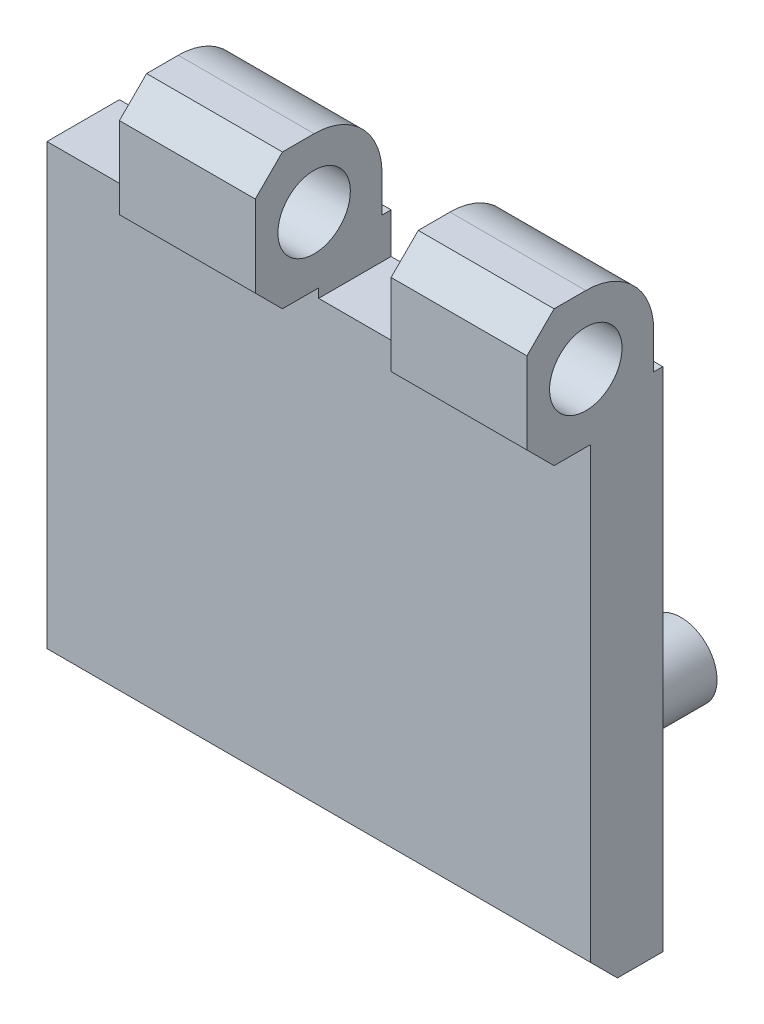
ISO-10303-21;
HEADER;
FILE_DESCRIPTION(('STEP AP214'),'2;1');
FILE_NAME('part.step','',(''),(''),'','','');
FILE_SCHEMA(('AUTOMOTIVE_DESIGN { 1 0 10303 214 1 1 1 1 }'));
ENDSEC;
DATA;
#1=APPLICATION_CONTEXT('core data for automotive mechanical design processes');
#2=APPLICATION_PROTOCOL_DEFINITION('international standard','automotive_design',2000,#1);
#3=PRODUCT_CONTEXT('',#1,'mechanical');
#4=PRODUCT('Part','Part','',(#3));
#5=PRODUCT_RELATED_PRODUCT_CATEGORY('part','',(#4));
#6=PRODUCT_DEFINITION_FORMATION('','',#4);
#7=PRODUCT_DEFINITION_CONTEXT('part definition',#1,'design');
#8=PRODUCT_DEFINITION('design','',#6,#7);
#9=PRODUCT_DEFINITION_SHAPE('','',#8);
#10=(LENGTH_UNIT() NAMED_UNIT(*) SI_UNIT(.MILLI.,.METRE.));
#11=(NAMED_UNIT(*) PLANE_ANGLE_UNIT() SI_UNIT($,.RADIAN.));
#12=(NAMED_UNIT(*) SI_UNIT($,.STERADIAN.) SOLID_ANGLE_UNIT());
#13=UNCERTAINTY_MEASURE_WITH_UNIT(LENGTH_MEASURE(1.E-05),#10,'distance_accuracy_value','');
#14=(GEOMETRIC_REPRESENTATION_CONTEXT(3) GLOBAL_UNCERTAINTY_ASSIGNED_CONTEXT((#13)) GLOBAL_UNIT_ASSIGNED_CONTEXT((#10,
#11,#12)) REPRESENTATION_CONTEXT('',''));
#15=CARTESIAN_POINT('',(0.,0.,0.));
#16=DIRECTION('',(0.,0.,1.));
#17=DIRECTION('',(1.,0.,0.));
#18=AXIS2_PLACEMENT_3D('',#15,#16,#17);
#19=CARTESIAN_POINT('',(-12.,-15.,0.));
#20=DIRECTION('',(0.,0.,-1.));
#21=DIRECTION('',(-1.,0.,0.));
#22=AXIS2_PLACEMENT_3D('',#19,#20,#21);
#23=PLANE('',#22);
#24=DIRECTION('',(-1.,0.,0.));
#25=VECTOR('',#24,1.);
#26=CARTESIAN_POINT('',(-12.,36.5,0.));
#27=LINE('',#26,#25);
#28=CARTESIAN_POINT('',(33.,36.5,0.));
#29=VERTEX_POINT('',#28);
#30=CARTESIAN_POINT('',(18.,36.5,0.));
#31=VERTEX_POINT('',#30);
#32=EDGE_CURVE('E18',#29,#31,#27,.T.);
#33=ORIENTED_EDGE('',*,*,#32,.F.);
#34=DIRECTION('',(0.,1.,0.));
#35=VECTOR('',#34,1.);
#36=CARTESIAN_POINT('',(33.,-15.,0.));
#37=LINE('',#36,#35);
#38=CARTESIAN_POINT('',(33.,40.97,0.));
#39=VERTEX_POINT('',#38);
#40=EDGE_CURVE('E214',#29,#39,#37,.T.);
#41=ORIENTED_EDGE('',*,*,#40,.T.);
#42=DIRECTION('',(1.,0.,0.));
#43=VECTOR('',#42,1.);
#44=CARTESIAN_POINT('',(-12.,40.97,0.));
#45=LINE('',#44,#43);
#46=CARTESIAN_POINT('',(48.,40.97,0.));
#47=VERTEX_POINT('',#46);
#48=EDGE_CURVE('E259',#39,#47,#45,.T.);
#49=ORIENTED_EDGE('',*,*,#48,.T.);
#50=DIRECTION('',(0.,1.,0.));
#51=VECTOR('',#50,1.);
#52=CARTESIAN_POINT('',(48.,-15.,0.));
#53=LINE('',#52,#51);
#54=CARTESIAN_POINT('',(48.,-15.,0.));
#55=VERTEX_POINT('',#54);
#56=EDGE_CURVE('E247',#55,#47,#53,.T.);
#57=ORIENTED_EDGE('',*,*,#56,.F.);
#58=DIRECTION('',(1.,0.,0.));
#59=VECTOR('',#58,1.);
#60=CARTESIAN_POINT('',(-12.,-15.,0.));
#61=LINE('',#60,#59);
#62=CARTESIAN_POINT('',(-12.,-15.,0.));
#63=VERTEX_POINT('',#62);
#64=EDGE_CURVE('E257',#63,#55,#61,.T.);
#65=ORIENTED_EDGE('',*,*,#64,.F.);
#66=DIRECTION('',(0.,1.,0.));
#67=VECTOR('',#66,1.);
#68=CARTESIAN_POINT('',(-12.,-15.,0.));
#69=LINE('',#68,#67);
#70=CARTESIAN_POINT('',(-12.,36.5,0.));
#71=VERTEX_POINT('',#70);
#72=EDGE_CURVE('E208',#63,#71,#69,.T.);
#73=ORIENTED_EDGE('',*,*,#72,.T.);
#74=DIRECTION('',(-1.,0.,0.));
#75=VECTOR('',#74,1.);
#76=CARTESIAN_POINT('',(-12.,36.5,0.));
#77=LINE('',#76,#75);
#78=CARTESIAN_POINT('',(3.,36.5,0.));
#79=VERTEX_POINT('',#78);
#80=EDGE_CURVE('E197',#79,#71,#77,.T.);
#81=ORIENTED_EDGE('',*,*,#80,.F.);
#82=DIRECTION('',(0.,1.,0.));
#83=VECTOR('',#82,1.);
#84=CARTESIAN_POINT('',(3.,-15.,0.));
#85=LINE('',#84,#83);
#86=CARTESIAN_POINT('',(3.,40.97,0.));
#87=VERTEX_POINT('',#86);
#88=EDGE_CURVE('E181',#79,#87,#85,.T.);
#89=ORIENTED_EDGE('',*,*,#88,.T.);
#90=CARTESIAN_POINT('',(18.,40.97,0.));
#91=VERTEX_POINT('',#90);
#92=EDGE_CURVE('E261',#87,#91,#45,.T.);
#93=ORIENTED_EDGE('',*,*,#92,.T.);
#94=DIRECTION('',(0.,1.,0.));
#95=VECTOR('',#94,1.);
#96=CARTESIAN_POINT('',(18.,-15.,0.));
#97=LINE('',#96,#95);
#98=EDGE_CURVE('E319',#31,#91,#97,.T.);
#99=ORIENTED_EDGE('',*,*,#98,.F.);
#100=EDGE_LOOP('',(#33,#41,#49,#57,#65,#73,#81,#89,#93,#99));
#101=FACE_BOUND('',#100,.T.);
#102=CARTESIAN_POINT('',(36.,0.,0.));
#103=DIRECTION('',(0.,0.,-1.));
#104=DIRECTION('',(-1.,0.,0.));
#105=AXIS2_PLACEMENT_3D('',#102,#103,#104);
#106=CIRCLE('',#105,4.);
#107=CARTESIAN_POINT('',(32.,0.,0.));
#108=VERTEX_POINT('',#107);
#109=EDGE_CURVE('E9',#108,#108,#106,.T.);
#110=ORIENTED_EDGE('',*,*,#109,.F.);
#111=EDGE_LOOP('',(#110));
#112=FACE_BOUND('',#111,.T.);
#113=CARTESIAN_POINT('',(0.,0.,0.));
#114=DIRECTION('',(0.,0.,-1.));
#115=DIRECTION('',(-1.,0.,0.));
#116=AXIS2_PLACEMENT_3D('',#113,#114,#115);
#117=CIRCLE('',#116,4.);
#118=CARTESIAN_POINT('',(-4.,0.,0.));
#119=VERTEX_POINT('',#118);
#120=EDGE_CURVE('E489',#119,#119,#117,.T.);
#121=ORIENTED_EDGE('',*,*,#120,.F.);
#122=EDGE_LOOP('',(#121));
#123=FACE_BOUND('',#122,.T.);
#124=ADVANCED_FACE('F14',(#101,#112,#123),#23,.T.);
#125=CARTESIAN_POINT('',(-12.,-15.,8.));
#126=DIRECTION('',(0.,0.,-1.));
#127=DIRECTION('',(-1.,0.,0.));
#128=AXIS2_PLACEMENT_3D('',#125,#126,#127);
#129=PLANE('',#128);
#130=DIRECTION('',(0.,1.,0.));
#131=VECTOR('',#130,1.);
#132=CARTESIAN_POINT('',(33.,-15.,8.));
#133=LINE('',#132,#131);
#134=CARTESIAN_POINT('',(33.,36.5,8.));
#135=VERTEX_POINT('',#134);
#136=CARTESIAN_POINT('',(33.,37.5,8.));
#137=VERTEX_POINT('',#136);
#138=EDGE_CURVE('E345',#135,#137,#133,.T.);
#139=ORIENTED_EDGE('',*,*,#138,.F.);
#140=DIRECTION('',(-1.,0.,0.));
#141=VECTOR('',#140,1.);
#142=CARTESIAN_POINT('',(-12.,36.5,8.));
#143=LINE('',#142,#141);
#144=CARTESIAN_POINT('',(18.,36.5,8.));
#145=VERTEX_POINT('',#144);
#146=EDGE_CURVE('E211',#135,#145,#143,.T.);
#147=ORIENTED_EDGE('',*,*,#146,.T.);
#148=DIRECTION('',(0.,1.,0.));
#149=VECTOR('',#148,1.);
#150=CARTESIAN_POINT('',(18.,-15.,8.));
#151=LINE('',#150,#149);
#152=CARTESIAN_POINT('',(18.,37.5,8.));
#153=VERTEX_POINT('',#152);
#154=EDGE_CURVE('E322',#145,#153,#151,.T.);
#155=ORIENTED_EDGE('',*,*,#154,.T.);
#156=DIRECTION('',(1.,0.,0.));
#157=VECTOR('',#156,1.);
#158=CARTESIAN_POINT('',(-12.,37.5,8.));
#159=LINE('',#158,#157);
#160=CARTESIAN_POINT('',(3.,37.5,8.));
#161=VERTEX_POINT('',#160);
#162=EDGE_CURVE('E273',#161,#153,#159,.T.);
#163=ORIENTED_EDGE('',*,*,#162,.F.);
#164=DIRECTION('',(0.,1.,0.));
#165=VECTOR('',#164,1.);
#166=CARTESIAN_POINT('',(3.,-15.,8.));
#167=LINE('',#166,#165);
#168=CARTESIAN_POINT('',(3.,36.5,8.));
#169=VERTEX_POINT('',#168);
#170=EDGE_CURVE('E470',#169,#161,#167,.T.);
#171=ORIENTED_EDGE('',*,*,#170,.F.);
#172=DIRECTION('',(-1.,0.,0.));
#173=VECTOR('',#172,1.);
#174=CARTESIAN_POINT('',(-12.,36.5,8.));
#175=LINE('',#174,#173);
#176=CARTESIAN_POINT('',(-12.,36.5,8.));
#177=VERTEX_POINT('',#176);
#178=EDGE_CURVE('E200',#169,#177,#175,.T.);
#179=ORIENTED_EDGE('',*,*,#178,.T.);
#180=DIRECTION('',(0.,1.,0.));
#181=VECTOR('',#180,1.);
#182=CARTESIAN_POINT('',(-12.,-15.,8.));
#183=LINE('',#182,#181);
#184=CARTESIAN_POINT('',(-12.,-12.,8.));
#185=VERTEX_POINT('',#184);
#186=EDGE_CURVE('E253',#185,#177,#183,.T.);
#187=ORIENTED_EDGE('',*,*,#186,.F.);
#188=DIRECTION('',(1.,0.,0.));
#189=VECTOR('',#188,1.);
#190=CARTESIAN_POINT('',(-12.,-12.,8.));
#191=LINE('',#190,#189);
#192=CARTESIAN_POINT('',(48.,-12.,8.));
#193=VERTEX_POINT('',#192);
#194=EDGE_CURVE('E274',#185,#193,#191,.T.);
#195=ORIENTED_EDGE('',*,*,#194,.T.);
#196=DIRECTION('',(0.,1.,0.));
#197=VECTOR('',#196,1.);
#198=CARTESIAN_POINT('',(48.,-15.,8.));
#199=LINE('',#198,#197);
#200=CARTESIAN_POINT('',(48.,37.5,8.));
#201=VERTEX_POINT('',#200);
#202=EDGE_CURVE('E226',#193,#201,#199,.T.);
#203=ORIENTED_EDGE('',*,*,#202,.T.);
#204=EDGE_CURVE('E271',#137,#201,#159,.T.);
#205=ORIENTED_EDGE('',*,*,#204,.F.);
#206=EDGE_LOOP('',(#139,#147,#155,#163,#171,#179,#187,#195,#203,#205));
#207=FACE_BOUND('',#206,.T.);
#208=ADVANCED_FACE('F16',(#207),#129,.F.);
#209=CARTESIAN_POINT('',(-12.,37.5,15.));
#210=DIRECTION('',(0.,-1.,0.));
#211=DIRECTION('',(0.,0.,-1.));
#212=AXIS2_PLACEMENT_3D('',#209,#210,#211);
#213=PLANE('',#212);
#214=DIRECTION('',(-1.,0.,0.));
#215=VECTOR('',#214,1.);
#216=CARTESIAN_POINT('',(-12.,37.5,12.));
#217=LINE('',#216,#215);
#218=CARTESIAN_POINT('',(48.,37.5,12.));
#219=VERTEX_POINT('',#218);
#220=CARTESIAN_POINT('',(33.,37.5,12.));
#221=VERTEX_POINT('',#220);
#222=EDGE_CURVE('E294',#219,#221,#217,.T.);
#223=ORIENTED_EDGE('',*,*,#222,.T.);
#224=DIRECTION('',(0.,0.,-1.));
#225=VECTOR('',#224,1.);
#226=CARTESIAN_POINT('',(33.,37.5,15.));
#227=LINE('',#226,#225);
#228=EDGE_CURVE('E342',#221,#137,#227,.T.);
#229=ORIENTED_EDGE('',*,*,#228,.T.);
#230=ORIENTED_EDGE('',*,*,#204,.T.);
#231=DIRECTION('',(0.,0.,-1.));
#232=VECTOR('',#231,1.);
#233=CARTESIAN_POINT('',(48.,37.5,15.));
#234=LINE('',#233,#232);
#235=EDGE_CURVE('E229',#219,#201,#234,.T.);
#236=ORIENTED_EDGE('',*,*,#235,.F.);
#237=EDGE_LOOP('',(#223,#229,#230,#236));
#238=FACE_BOUND('',#237,.T.);
#239=ADVANCED_FACE('F379',(#238),#213,.T.);
#240=DIRECTION('',(0.,0.,-1.));
#241=VECTOR('',#240,1.);
#242=CARTESIAN_POINT('',(18.,37.5,15.));
#243=LINE('',#242,#241);
#244=CARTESIAN_POINT('',(18.,37.5,12.));
#245=VERTEX_POINT('',#244);
#246=EDGE_CURVE('E454',#245,#153,#243,.T.);
#247=ORIENTED_EDGE('',*,*,#246,.F.);
#248=CARTESIAN_POINT('',(3.,37.5,12.));
#249=VERTEX_POINT('',#248);
#250=EDGE_CURVE('E298',#245,#249,#217,.T.);
#251=ORIENTED_EDGE('',*,*,#250,.T.);
#252=DIRECTION('',(0.,0.,-1.));
#253=VECTOR('',#252,1.);
#254=CARTESIAN_POINT('',(3.,37.5,15.));
#255=LINE('',#254,#253);
#256=EDGE_CURVE('E472',#249,#161,#255,.T.);
#257=ORIENTED_EDGE('',*,*,#256,.T.);
#258=ORIENTED_EDGE('',*,*,#162,.T.);
#259=EDGE_LOOP('',(#247,#251,#257,#258));
#260=FACE_BOUND('',#259,.T.);
#261=ADVANCED_FACE('F568',(#260),#213,.T.);
#262=CARTESIAN_POINT('',(-12.,37.5,15.));
#263=DIRECTION('',(0.,0.,-1.));
#264=DIRECTION('',(0.,1.,0.));
#265=AXIS2_PLACEMENT_3D('',#262,#263,#264);
#266=PLANE('',#265);
#267=DIRECTION('',(0.,1.,0.));
#268=VECTOR('',#267,1.);
#269=CARTESIAN_POINT('',(33.,37.5,15.));
#270=LINE('',#269,#268);
#271=CARTESIAN_POINT('',(33.,40.5,15.));
#272=VERTEX_POINT('',#271);
#273=CARTESIAN_POINT('',(33.,49.5,15.));
#274=VERTEX_POINT('',#273);
#275=EDGE_CURVE('E335',#272,#274,#270,.T.);
#276=ORIENTED_EDGE('',*,*,#275,.F.);
#277=DIRECTION('',(1.,0.,0.));
#278=VECTOR('',#277,1.);
#279=CARTESIAN_POINT('',(48.,40.5,15.));
#280=LINE('',#279,#278);
#281=CARTESIAN_POINT('',(48.,40.5,15.));
#282=VERTEX_POINT('',#281);
#283=EDGE_CURVE('E291',#272,#282,#280,.T.);
#284=ORIENTED_EDGE('',*,*,#283,.T.);
#285=DIRECTION('',(0.,1.,0.));
#286=VECTOR('',#285,1.);
#287=CARTESIAN_POINT('',(48.,37.5,15.));
#288=LINE('',#287,#286);
#289=CARTESIAN_POINT('',(48.,49.5,15.));
#290=VERTEX_POINT('',#289);
#291=EDGE_CURVE('E232',#282,#290,#288,.T.);
#292=ORIENTED_EDGE('',*,*,#291,.T.);
#293=DIRECTION('',(-1.,0.,0.));
#294=VECTOR('',#293,1.);
#295=CARTESIAN_POINT('',(-12.,49.5,15.));
#296=LINE('',#295,#294);
#297=EDGE_CURVE('E288',#290,#274,#296,.T.);
#298=ORIENTED_EDGE('',*,*,#297,.T.);
#299=EDGE_LOOP('',(#276,#284,#292,#298));
#300=FACE_BOUND('',#299,.T.);
#301=ADVANCED_FACE('F390',(#300),#266,.F.);
#302=CARTESIAN_POINT('',(3.,40.5,15.));
#303=VERTEX_POINT('',#302);
#304=CARTESIAN_POINT('',(18.,40.5,15.));
#305=VERTEX_POINT('',#304);
#306=EDGE_CURVE('E293',#303,#305,#280,.T.);
#307=ORIENTED_EDGE('',*,*,#306,.T.);
#308=DIRECTION('',(0.,1.,0.));
#309=VECTOR('',#308,1.);
#310=CARTESIAN_POINT('',(18.,37.5,15.));
#311=LINE('',#310,#309);
#312=CARTESIAN_POINT('',(18.,49.5,15.));
#313=VERTEX_POINT('',#312);
#314=EDGE_CURVE('E462',#305,#313,#311,.T.);
#315=ORIENTED_EDGE('',*,*,#314,.T.);
#316=CARTESIAN_POINT('',(3.,49.5,15.));
#317=VERTEX_POINT('',#316);
#318=EDGE_CURVE('E287',#313,#317,#296,.T.);
#319=ORIENTED_EDGE('',*,*,#318,.T.);
#320=DIRECTION('',(0.,1.,0.));
#321=VECTOR('',#320,1.);
#322=CARTESIAN_POINT('',(3.,37.5,15.));
#323=LINE('',#322,#321);
#324=EDGE_CURVE('E38',#303,#317,#323,.T.);
#325=ORIENTED_EDGE('',*,*,#324,.F.);
#326=EDGE_LOOP('',(#307,#315,#319,#325));
#327=FACE_BOUND('',#326,.T.);
#328=ADVANCED_FACE('F560',(#327),#266,.F.);
#329=CARTESIAN_POINT('',(-12.,52.5,15.));
#330=DIRECTION('',(0.,-1.,0.));
#331=DIRECTION('',(0.,0.,-1.));
#332=AXIS2_PLACEMENT_3D('',#329,#330,#331);
#333=PLANE('',#332);
#334=DIRECTION('',(0.,0.,-1.));
#335=VECTOR('',#334,1.);
#336=CARTESIAN_POINT('',(33.,52.5,15.));
#337=LINE('',#336,#335);
#338=CARTESIAN_POINT('',(33.,52.5,12.));
#339=VERTEX_POINT('',#338);
#340=CARTESIAN_POINT('',(33.,52.5,8.5));
#341=VERTEX_POINT('',#340);
#342=EDGE_CURVE('E328',#339,#341,#337,.T.);
#343=ORIENTED_EDGE('',*,*,#342,.F.);
#344=DIRECTION('',(1.,0.,0.));
#345=VECTOR('',#344,1.);
#346=CARTESIAN_POINT('',(-12.,52.5,12.));
#347=LINE('',#346,#345);
#348=CARTESIAN_POINT('',(48.,52.5,12.));
#349=VERTEX_POINT('',#348);
#350=EDGE_CURVE('E297',#339,#349,#347,.T.);
#351=ORIENTED_EDGE('',*,*,#350,.T.);
#352=DIRECTION('',(0.,0.,-1.));
#353=VECTOR('',#352,1.);
#354=CARTESIAN_POINT('',(48.,52.5,15.));
#355=LINE('',#354,#353);
#356=CARTESIAN_POINT('',(48.,52.5,8.5));
#357=VERTEX_POINT('',#356);
#358=EDGE_CURVE('E235',#349,#357,#355,.T.);
#359=ORIENTED_EDGE('',*,*,#358,.T.);
#360=DIRECTION('',(1.,0.,0.));
#361=VECTOR('',#360,1.);
#362=CARTESIAN_POINT('',(-12.,52.5,8.5));
#363=LINE('',#362,#361);
#364=EDGE_CURVE('E268',#341,#357,#363,.T.);
#365=ORIENTED_EDGE('',*,*,#364,.F.);
#366=EDGE_LOOP('',(#343,#351,#359,#365));
#367=FACE_BOUND('',#366,.T.);
#368=ADVANCED_FACE('F399',(#367),#333,.F.);
#369=CARTESIAN_POINT('',(3.,52.5,12.));
#370=VERTEX_POINT('',#369);
#371=CARTESIAN_POINT('',(18.,52.5,12.));
#372=VERTEX_POINT('',#371);
#373=EDGE_CURVE('E300',#370,#372,#347,.T.);
#374=ORIENTED_EDGE('',*,*,#373,.T.);
#375=DIRECTION('',(0.,0.,-1.));
#376=VECTOR('',#375,1.);
#377=CARTESIAN_POINT('',(18.,52.5,15.));
#378=LINE('',#377,#376);
#379=CARTESIAN_POINT('',(18.,52.5,8.5));
#380=VERTEX_POINT('',#379);
#381=EDGE_CURVE('E30',#372,#380,#378,.T.);
#382=ORIENTED_EDGE('',*,*,#381,.T.);
#383=CARTESIAN_POINT('',(3.,52.5,8.5));
#384=VERTEX_POINT('',#383);
#385=EDGE_CURVE('E270',#384,#380,#363,.T.);
#386=ORIENTED_EDGE('',*,*,#385,.F.);
#387=DIRECTION('',(0.,0.,-1.));
#388=VECTOR('',#387,1.);
#389=CARTESIAN_POINT('',(3.,52.5,15.));
#390=LINE('',#389,#388);
#391=EDGE_CURVE('E481',#370,#384,#390,.T.);
#392=ORIENTED_EDGE('',*,*,#391,.F.);
#393=EDGE_LOOP('',(#374,#382,#386,#392));
#394=FACE_BOUND('',#393,.T.);
#395=ADVANCED_FACE('F554',(#394),#333,.F.);
#396=CARTESIAN_POINT('',(-12.,45.,8.5));
#397=DIRECTION('',(1.,0.,0.));
#398=DIRECTION('',(0.,1.,0.));
#399=AXIS2_PLACEMENT_3D('',#396,#397,#398);
#400=CYLINDRICAL_SURFACE('',#399,7.5);
#401=CARTESIAN_POINT('',(33.,45.,8.5));
#402=DIRECTION('',(-1.,0.,0.));
#403=DIRECTION('',(0.,-1.,0.));
#404=AXIS2_PLACEMENT_3D('',#401,#402,#403);
#405=CIRCLE('',#404,7.5);
#406=CARTESIAN_POINT('',(33.,45.,1.));
#407=VERTEX_POINT('',#406);
#408=EDGE_CURVE('E340',#341,#407,#405,.T.);
#409=ORIENTED_EDGE('',*,*,#408,.F.);
#410=ORIENTED_EDGE('',*,*,#364,.T.);
#411=CARTESIAN_POINT('',(48.,45.,8.5));
#412=DIRECTION('',(-1.,0.,0.));
#413=DIRECTION('',(0.,-1.,0.));
#414=AXIS2_PLACEMENT_3D('',#411,#412,#413);
#415=CIRCLE('',#414,7.5);
#416=CARTESIAN_POINT('',(48.,45.,1.));
#417=VERTEX_POINT('',#416);
#418=EDGE_CURVE('E238',#357,#417,#415,.T.);
#419=ORIENTED_EDGE('',*,*,#418,.T.);
#420=DIRECTION('',(1.,0.,0.));
#421=VECTOR('',#420,1.);
#422=CARTESIAN_POINT('',(-12.,45.,1.));
#423=LINE('',#422,#421);
#424=EDGE_CURVE('E265',#407,#417,#423,.T.);
#425=ORIENTED_EDGE('',*,*,#424,.F.);
#426=EDGE_LOOP('',(#409,#410,#419,#425));
#427=FACE_BOUND('',#426,.T.);
#428=ADVANCED_FACE('F406',(#427),#400,.T.);
#429=ORIENTED_EDGE('',*,*,#385,.T.);
#430=CARTESIAN_POINT('',(18.,45.,8.5));
#431=DIRECTION('',(-1.,0.,0.));
#432=DIRECTION('',(0.,-1.,0.));
#433=AXIS2_PLACEMENT_3D('',#430,#431,#432);
#434=CIRCLE('',#433,7.5);
#435=CARTESIAN_POINT('',(18.,45.,1.));
#436=VERTEX_POINT('',#435);
#437=EDGE_CURVE('E458',#380,#436,#434,.T.);
#438=ORIENTED_EDGE('',*,*,#437,.T.);
#439=CARTESIAN_POINT('',(3.,45.,1.));
#440=VERTEX_POINT('',#439);
#441=EDGE_CURVE('E267',#440,#436,#423,.T.);
#442=ORIENTED_EDGE('',*,*,#441,.F.);
#443=CARTESIAN_POINT('',(3.,45.,8.5));
#444=DIRECTION('',(-1.,0.,0.));
#445=DIRECTION('',(0.,-1.,0.));
#446=AXIS2_PLACEMENT_3D('',#443,#444,#445);
#447=CIRCLE('',#446,7.5);
#448=EDGE_CURVE('E475',#384,#440,#447,.T.);
#449=ORIENTED_EDGE('',*,*,#448,.F.);
#450=EDGE_LOOP('',(#429,#438,#442,#449));
#451=FACE_BOUND('',#450,.T.);
#452=ADVANCED_FACE('F411',(#451),#400,.T.);
#453=CARTESIAN_POINT('',(-12.,45.,1.));
#454=DIRECTION('',(0.,0.,1.));
#455=DIRECTION('',(0.,-1.,0.));
#456=AXIS2_PLACEMENT_3D('',#453,#454,#455);
#457=PLANE('',#456);
#458=DIRECTION('',(0.,-1.,0.));
#459=VECTOR('',#458,1.);
#460=CARTESIAN_POINT('',(33.,45.,1.));
#461=LINE('',#460,#459);
#462=CARTESIAN_POINT('',(33.,40.97,1.));
#463=VERTEX_POINT('',#462);
#464=EDGE_CURVE('E347',#407,#463,#461,.T.);
#465=ORIENTED_EDGE('',*,*,#464,.F.);
#466=ORIENTED_EDGE('',*,*,#424,.T.);
#467=DIRECTION('',(0.,-1.,0.));
#468=VECTOR('',#467,1.);
#469=CARTESIAN_POINT('',(48.,45.,1.));
#470=LINE('',#469,#468);
#471=CARTESIAN_POINT('',(48.,40.97,1.));
#472=VERTEX_POINT('',#471);
#473=EDGE_CURVE('E241',#417,#472,#470,.T.);
#474=ORIENTED_EDGE('',*,*,#473,.T.);
#475=DIRECTION('',(1.,0.,0.));
#476=VECTOR('',#475,1.);
#477=CARTESIAN_POINT('',(-12.,40.97,1.));
#478=LINE('',#477,#476);
#479=EDGE_CURVE('E262',#463,#472,#478,.T.);
#480=ORIENTED_EDGE('',*,*,#479,.F.);
#481=EDGE_LOOP('',(#465,#466,#474,#480));
#482=FACE_BOUND('',#481,.T.);
#483=ADVANCED_FACE('F408',(#482),#457,.F.);
#484=ORIENTED_EDGE('',*,*,#441,.T.);
#485=DIRECTION('',(0.,-1.,0.));
#486=VECTOR('',#485,1.);
#487=CARTESIAN_POINT('',(18.,45.,1.));
#488=LINE('',#487,#486);
#489=CARTESIAN_POINT('',(18.,40.97,1.));
#490=VERTEX_POINT('',#489);
#491=EDGE_CURVE('E330',#436,#490,#488,.T.);
#492=ORIENTED_EDGE('',*,*,#491,.T.);
#493=CARTESIAN_POINT('',(3.,40.97,1.));
#494=VERTEX_POINT('',#493);
#495=EDGE_CURVE('E264',#494,#490,#478,.T.);
#496=ORIENTED_EDGE('',*,*,#495,.F.);
#497=DIRECTION('',(0.,-1.,0.));
#498=VECTOR('',#497,1.);
#499=CARTESIAN_POINT('',(3.,45.,1.));
#500=LINE('',#499,#498);
#501=EDGE_CURVE('E451',#440,#494,#500,.T.);
#502=ORIENTED_EDGE('',*,*,#501,.F.);
#503=EDGE_LOOP('',(#484,#492,#496,#502));
#504=FACE_BOUND('',#503,.T.);
#505=ADVANCED_FACE('F410',(#504),#457,.F.);
#506=CARTESIAN_POINT('',(-12.,40.97,1.));
#507=DIRECTION('',(0.,-1.,0.));
#508=DIRECTION('',(1.,0.,0.));
#509=AXIS2_PLACEMENT_3D('',#506,#507,#508);
#510=PLANE('',#509);
#511=DIRECTION('',(0.,0.,-1.));
#512=VECTOR('',#511,1.);
#513=CARTESIAN_POINT('',(33.,40.97,1.));
#514=LINE('',#513,#512);
#515=EDGE_CURVE('E349',#463,#39,#514,.T.);
#516=ORIENTED_EDGE('',*,*,#515,.F.);
#517=ORIENTED_EDGE('',*,*,#479,.T.);
#518=DIRECTION('',(0.,0.,-1.));
#519=VECTOR('',#518,1.);
#520=CARTESIAN_POINT('',(48.,40.97,1.));
#521=LINE('',#520,#519);
#522=EDGE_CURVE('E244',#472,#47,#521,.T.);
#523=ORIENTED_EDGE('',*,*,#522,.T.);
#524=ORIENTED_EDGE('',*,*,#48,.F.);
#525=EDGE_LOOP('',(#516,#517,#523,#524));
#526=FACE_BOUND('',#525,.T.);
#527=ADVANCED_FACE('F355',(#526),#510,.F.);
#528=ORIENTED_EDGE('',*,*,#495,.T.);
#529=DIRECTION('',(0.,0.,-1.));
#530=VECTOR('',#529,1.);
#531=CARTESIAN_POINT('',(18.,40.97,1.));
#532=LINE('',#531,#530);
#533=EDGE_CURVE('E325',#490,#91,#532,.T.);
#534=ORIENTED_EDGE('',*,*,#533,.T.);
#535=ORIENTED_EDGE('',*,*,#92,.F.);
#536=DIRECTION('',(0.,0.,-1.));
#537=VECTOR('',#536,1.);
#538=CARTESIAN_POINT('',(3.,40.97,1.));
#539=LINE('',#538,#537);
#540=EDGE_CURVE('E188',#494,#87,#539,.T.);
#541=ORIENTED_EDGE('',*,*,#540,.F.);
#542=EDGE_LOOP('',(#528,#534,#535,#541));
#543=FACE_BOUND('',#542,.T.);
#544=ADVANCED_FACE('F432',(#543),#510,.F.);
#545=CARTESIAN_POINT('',(-12.,45.,8.5));
#546=DIRECTION('',(1.,0.,0.));
#547=DIRECTION('',(0.,1.,0.));
#548=AXIS2_PLACEMENT_3D('',#545,#546,#547);
#549=CYLINDRICAL_SURFACE('',#548,4.);
#550=CARTESIAN_POINT('',(48.,45.,8.5));
#551=DIRECTION('',(1.,0.,0.));
#552=DIRECTION('',(0.,1.,0.));
#553=AXIS2_PLACEMENT_3D('',#550,#551,#552);
#554=CIRCLE('',#553,4.);
#555=CARTESIAN_POINT('',(48.,49.,8.5));
#556=VERTEX_POINT('',#555);
#557=EDGE_CURVE('E220',#556,#556,#554,.T.);
#558=ORIENTED_EDGE('',*,*,#557,.T.);
#559=EDGE_LOOP('',(#558));
#560=FACE_BOUND('',#559,.T.);
#561=CARTESIAN_POINT('',(33.,45.,8.5));
#562=DIRECTION('',(-1.,0.,0.));
#563=DIRECTION('',(0.,-1.,0.));
#564=AXIS2_PLACEMENT_3D('',#561,#562,#563);
#565=CIRCLE('',#564,4.);
#566=CARTESIAN_POINT('',(33.,41.,8.5));
#567=VERTEX_POINT('',#566);
#568=EDGE_CURVE('E209',#567,#567,#565,.F.);
#569=ORIENTED_EDGE('',*,*,#568,.F.);
#570=EDGE_LOOP('',(#569));
#571=FACE_BOUND('',#570,.T.);
#572=ADVANCED_FACE('F437',(#560,#571),#549,.F.);
#573=CARTESIAN_POINT('',(-12.,40.5,15.));
#574=DIRECTION('',(0.,-0.707106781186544,0.707106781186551));
#575=DIRECTION('',(0.,-0.707106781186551,-0.707106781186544));
#576=AXIS2_PLACEMENT_3D('',#573,#574,#575);
#577=PLANE('',#576);
#578=ORIENTED_EDGE('',*,*,#283,.F.);
#579=DIRECTION('',(0.,-0.707106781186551,-0.707106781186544));
#580=VECTOR('',#579,1.);
#581=CARTESIAN_POINT('',(33.,40.5,15.));
#582=LINE('',#581,#580);
#583=EDGE_CURVE('E337',#272,#221,#582,.T.);
#584=ORIENTED_EDGE('',*,*,#583,.T.);
#585=ORIENTED_EDGE('',*,*,#222,.F.);
#586=DIRECTION('',(0.,-0.707106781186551,-0.707106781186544));
#587=VECTOR('',#586,1.);
#588=CARTESIAN_POINT('',(48.,40.5,15.));
#589=LINE('',#588,#587);
#590=EDGE_CURVE('E279',#282,#219,#589,.T.);
#591=ORIENTED_EDGE('',*,*,#590,.F.);
#592=EDGE_LOOP('',(#578,#584,#585,#591));
#593=FACE_BOUND('',#592,.T.);
#594=ADVANCED_FACE('F386',(#593),#577,.T.);
#595=DIRECTION('',(0.,-0.707106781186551,-0.707106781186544));
#596=VECTOR('',#595,1.);
#597=CARTESIAN_POINT('',(18.,40.5,15.));
#598=LINE('',#597,#596);
#599=EDGE_CURVE('E460',#305,#245,#598,.T.);
#600=ORIENTED_EDGE('',*,*,#599,.F.);
#601=ORIENTED_EDGE('',*,*,#306,.F.);
#602=DIRECTION('',(0.,-0.707106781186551,-0.707106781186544));
#603=VECTOR('',#602,1.);
#604=CARTESIAN_POINT('',(3.,40.5,15.));
#605=LINE('',#604,#603);
#606=EDGE_CURVE('E477',#303,#249,#605,.T.);
#607=ORIENTED_EDGE('',*,*,#606,.T.);
#608=ORIENTED_EDGE('',*,*,#250,.F.);
#609=EDGE_LOOP('',(#600,#601,#607,#608));
#610=FACE_BOUND('',#609,.T.);
#611=ADVANCED_FACE('F528',(#610),#577,.T.);
#612=CARTESIAN_POINT('',(-12.,52.5,12.));
#613=DIRECTION('',(0.,-0.707106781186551,-0.707106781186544));
#614=DIRECTION('',(0.,0.707106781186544,-0.707106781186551));
#615=AXIS2_PLACEMENT_3D('',#612,#613,#614);
#616=PLANE('',#615);
#617=ORIENTED_EDGE('',*,*,#350,.F.);
#618=DIRECTION('',(0.,0.707106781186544,-0.707106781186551));
#619=VECTOR('',#618,1.);
#620=CARTESIAN_POINT('',(33.,52.5,12.));
#621=LINE('',#620,#619);
#622=EDGE_CURVE('E305',#339,#274,#621,.F.);
#623=ORIENTED_EDGE('',*,*,#622,.T.);
#624=ORIENTED_EDGE('',*,*,#297,.F.);
#625=DIRECTION('',(0.,0.707106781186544,-0.707106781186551));
#626=VECTOR('',#625,1.);
#627=CARTESIAN_POINT('',(48.,52.5,12.));
#628=LINE('',#627,#626);
#629=EDGE_CURVE('E277',#349,#290,#628,.F.);
#630=ORIENTED_EDGE('',*,*,#629,.F.);
#631=EDGE_LOOP('',(#617,#623,#624,#630));
#632=FACE_BOUND('',#631,.T.);
#633=ADVANCED_FACE('F395',(#632),#616,.F.);
#634=DIRECTION('',(0.,0.707106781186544,-0.707106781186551));
#635=VECTOR('',#634,1.);
#636=CARTESIAN_POINT('',(18.,52.5,12.));
#637=LINE('',#636,#635);
#638=EDGE_CURVE('E303',#372,#313,#637,.F.);
#639=ORIENTED_EDGE('',*,*,#638,.F.);
#640=ORIENTED_EDGE('',*,*,#373,.F.);
#641=DIRECTION('',(0.,0.707106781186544,-0.707106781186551));
#642=VECTOR('',#641,1.);
#643=CARTESIAN_POINT('',(3.,52.5,12.));
#644=LINE('',#643,#642);
#645=EDGE_CURVE('E301',#370,#317,#644,.F.);
#646=ORIENTED_EDGE('',*,*,#645,.T.);
#647=ORIENTED_EDGE('',*,*,#318,.F.);
#648=EDGE_LOOP('',(#639,#640,#646,#647));
#649=FACE_BOUND('',#648,.T.);
#650=ADVANCED_FACE('F527',(#649),#616,.F.);
#651=CARTESIAN_POINT('',(-12.,-15.,0.));
#652=DIRECTION('',(0.,1.,0.));
#653=DIRECTION('',(-1.,0.,0.));
#654=AXIS2_PLACEMENT_3D('',#651,#652,#653);
#655=PLANE('',#654);
#656=DIRECTION('',(0.,0.,1.));
#657=VECTOR('',#656,1.);
#658=CARTESIAN_POINT('',(48.,-15.,0.));
#659=LINE('',#658,#657);
#660=CARTESIAN_POINT('',(48.,-15.,5.));
#661=VERTEX_POINT('',#660);
#662=EDGE_CURVE('E223',#55,#661,#659,.T.);
#663=ORIENTED_EDGE('',*,*,#662,.T.);
#664=DIRECTION('',(-1.,0.,0.));
#665=VECTOR('',#664,1.);
#666=CARTESIAN_POINT('',(-12.,-15.,5.));
#667=LINE('',#666,#665);
#668=CARTESIAN_POINT('',(-12.,-15.,5.));
#669=VERTEX_POINT('',#668);
#670=EDGE_CURVE('E283',#661,#669,#667,.T.);
#671=ORIENTED_EDGE('',*,*,#670,.T.);
#672=DIRECTION('',(0.,0.,1.));
#673=VECTOR('',#672,1.);
#674=CARTESIAN_POINT('',(-12.,-15.,0.));
#675=LINE('',#674,#673);
#676=EDGE_CURVE('E250',#63,#669,#675,.T.);
#677=ORIENTED_EDGE('',*,*,#676,.F.);
#678=ORIENTED_EDGE('',*,*,#64,.T.);
#679=EDGE_LOOP('',(#663,#671,#677,#678));
#680=FACE_BOUND('',#679,.T.);
#681=ADVANCED_FACE('F365',(#680),#655,.F.);
#682=CARTESIAN_POINT('',(-12.,45.,8.5));
#683=DIRECTION('',(-1.,0.,0.));
#684=DIRECTION('',(0.,-1.,0.));
#685=AXIS2_PLACEMENT_3D('',#682,#683,#684);
#686=PLANE('',#685);
#687=DIRECTION('',(0.,0.,1.));
#688=VECTOR('',#687,1.);
#689=CARTESIAN_POINT('',(-12.,36.5,8.5));
#690=LINE('',#689,#688);
#691=EDGE_CURVE('E307',#71,#177,#690,.T.);
#692=ORIENTED_EDGE('',*,*,#691,.F.);
#693=ORIENTED_EDGE('',*,*,#72,.F.);
#694=ORIENTED_EDGE('',*,*,#676,.T.);
#695=DIRECTION('',(0.,-0.707106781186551,-0.707106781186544));
#696=VECTOR('',#695,1.);
#697=CARTESIAN_POINT('',(-12.,16.75,36.75));
#698=LINE('',#697,#696);
#699=EDGE_CURVE('E285',#669,#185,#698,.F.);
#700=ORIENTED_EDGE('',*,*,#699,.T.);
#701=ORIENTED_EDGE('',*,*,#186,.T.);
#702=EDGE_LOOP('',(#692,#693,#694,#700,#701));
#703=FACE_BOUND('',#702,.T.);
#704=ADVANCED_FACE('F369',(#703),#686,.T.);
#705=CARTESIAN_POINT('',(48.,45.,8.5));
#706=DIRECTION('',(-1.,0.,0.));
#707=DIRECTION('',(0.,-1.,0.));
#708=AXIS2_PLACEMENT_3D('',#705,#706,#707);
#709=PLANE('',#708);
#710=ORIENTED_EDGE('',*,*,#557,.F.);
#711=EDGE_LOOP('',(#710));
#712=FACE_BOUND('',#711,.T.);
#713=ORIENTED_EDGE('',*,*,#202,.F.);
#714=DIRECTION('',(0.,0.707106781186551,0.707106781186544));
#715=VECTOR('',#714,1.);
#716=CARTESIAN_POINT('',(48.,-12.,8.));
#717=LINE('',#716,#715);
#718=EDGE_CURVE('E281',#193,#661,#717,.F.);
#719=ORIENTED_EDGE('',*,*,#718,.T.);
#720=ORIENTED_EDGE('',*,*,#662,.F.);
#721=ORIENTED_EDGE('',*,*,#56,.T.);
#722=ORIENTED_EDGE('',*,*,#522,.F.);
#723=ORIENTED_EDGE('',*,*,#473,.F.);
#724=ORIENTED_EDGE('',*,*,#418,.F.);
#725=ORIENTED_EDGE('',*,*,#358,.F.);
#726=ORIENTED_EDGE('',*,*,#629,.T.);
#727=ORIENTED_EDGE('',*,*,#291,.F.);
#728=ORIENTED_EDGE('',*,*,#590,.T.);
#729=ORIENTED_EDGE('',*,*,#235,.T.);
#730=EDGE_LOOP('',(#713,#719,#720,#721,#722,#723,#724,#725,#726,#727,#728,#729));
#731=FACE_BOUND('',#730,.T.);
#732=ADVANCED_FACE('F362',(#712,#731),#709,.F.);
#733=CARTESIAN_POINT('',(-12.,-12.,8.));
#734=DIRECTION('',(0.,0.707106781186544,-0.707106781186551));
#735=DIRECTION('',(0.,0.707106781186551,0.707106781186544));
#736=AXIS2_PLACEMENT_3D('',#733,#734,#735);
#737=PLANE('',#736);
#738=ORIENTED_EDGE('',*,*,#699,.F.);
#739=ORIENTED_EDGE('',*,*,#670,.F.);
#740=ORIENTED_EDGE('',*,*,#718,.F.);
#741=ORIENTED_EDGE('',*,*,#194,.F.);
#742=EDGE_LOOP('',(#738,#739,#740,#741));
#743=FACE_BOUND('',#742,.T.);
#744=ADVANCED_FACE('F375',(#743),#737,.F.);
#745=CARTESIAN_POINT('',(3.,65.,-5.));
#746=DIRECTION('',(-1.,0.,0.));
#747=DIRECTION('',(0.,-1.,0.));
#748=AXIS2_PLACEMENT_3D('',#745,#746,#747);
#749=PLANE('',#748);
#750=DIRECTION('',(0.,0.,1.));
#751=VECTOR('',#750,1.);
#752=CARTESIAN_POINT('',(3.,36.5,-5.));
#753=LINE('',#752,#751);
#754=EDGE_CURVE('E185',#79,#169,#753,.T.);
#755=ORIENTED_EDGE('',*,*,#754,.T.);
#756=ORIENTED_EDGE('',*,*,#170,.T.);
#757=ORIENTED_EDGE('',*,*,#256,.F.);
#758=ORIENTED_EDGE('',*,*,#606,.F.);
#759=ORIENTED_EDGE('',*,*,#324,.T.);
#760=ORIENTED_EDGE('',*,*,#645,.F.);
#761=ORIENTED_EDGE('',*,*,#391,.T.);
#762=ORIENTED_EDGE('',*,*,#448,.T.);
#763=ORIENTED_EDGE('',*,*,#501,.T.);
#764=ORIENTED_EDGE('',*,*,#540,.T.);
#765=ORIENTED_EDGE('',*,*,#88,.F.);
#766=EDGE_LOOP('',(#755,#756,#757,#758,#759,#760,#761,#762,#763,#764,#765));
#767=FACE_BOUND('',#766,.T.);
#768=CARTESIAN_POINT('',(3.,45.,8.5));
#769=DIRECTION('',(-1.,0.,0.));
#770=DIRECTION('',(0.,-1.,0.));
#771=AXIS2_PLACEMENT_3D('',#768,#769,#770);
#772=CIRCLE('',#771,4.);
#773=CARTESIAN_POINT('',(3.,41.,8.5));
#774=VERTEX_POINT('',#773);
#775=EDGE_CURVE('E193',#774,#774,#772,.F.);
#776=ORIENTED_EDGE('',*,*,#775,.T.);
#777=EDGE_LOOP('',(#776));
#778=FACE_BOUND('',#777,.T.);
#779=ADVANCED_FACE('F183',(#767,#778),#749,.T.);
#780=CARTESIAN_POINT('',(-24.5,36.5,-5.));
#781=DIRECTION('',(0.,-1.,0.));
#782=DIRECTION('',(0.,0.,-1.));
#783=AXIS2_PLACEMENT_3D('',#780,#781,#782);
#784=PLANE('',#783);
#785=ORIENTED_EDGE('',*,*,#754,.F.);
#786=ORIENTED_EDGE('',*,*,#80,.T.);
#787=ORIENTED_EDGE('',*,*,#691,.T.);
#788=ORIENTED_EDGE('',*,*,#178,.F.);
#789=EDGE_LOOP('',(#785,#786,#787,#788));
#790=FACE_BOUND('',#789,.T.);
#791=ADVANCED_FACE('F196',(#790),#784,.F.);
#792=CARTESIAN_POINT('',(18.,36.5,-5.));
#793=DIRECTION('',(0.,-1.,0.));
#794=DIRECTION('',(0.,0.,-1.));
#795=AXIS2_PLACEMENT_3D('',#792,#793,#794);
#796=PLANE('',#795);
#797=DIRECTION('',(0.,0.,1.));
#798=VECTOR('',#797,1.);
#799=CARTESIAN_POINT('',(33.,36.5,-5.));
#800=LINE('',#799,#798);
#801=EDGE_CURVE('E314',#29,#135,#800,.T.);
#802=ORIENTED_EDGE('',*,*,#801,.F.);
#803=ORIENTED_EDGE('',*,*,#32,.T.);
#804=DIRECTION('',(0.,0.,1.));
#805=VECTOR('',#804,1.);
#806=CARTESIAN_POINT('',(18.,36.5,-5.));
#807=LINE('',#806,#805);
#808=EDGE_CURVE('E201',#31,#145,#807,.T.);
#809=ORIENTED_EDGE('',*,*,#808,.T.);
#810=ORIENTED_EDGE('',*,*,#146,.F.);
#811=EDGE_LOOP('',(#802,#803,#809,#810));
#812=FACE_BOUND('',#811,.T.);
#813=ADVANCED_FACE('F312',(#812),#796,.F.);
#814=CARTESIAN_POINT('',(33.,65.,-5.));
#815=DIRECTION('',(-1.,0.,0.));
#816=DIRECTION('',(0.,-1.,0.));
#817=AXIS2_PLACEMENT_3D('',#814,#815,#816);
#818=PLANE('',#817);
#819=ORIENTED_EDGE('',*,*,#801,.T.);
#820=ORIENTED_EDGE('',*,*,#138,.T.);
#821=ORIENTED_EDGE('',*,*,#228,.F.);
#822=ORIENTED_EDGE('',*,*,#583,.F.);
#823=ORIENTED_EDGE('',*,*,#275,.T.);
#824=ORIENTED_EDGE('',*,*,#622,.F.);
#825=ORIENTED_EDGE('',*,*,#342,.T.);
#826=ORIENTED_EDGE('',*,*,#408,.T.);
#827=ORIENTED_EDGE('',*,*,#464,.T.);
#828=ORIENTED_EDGE('',*,*,#515,.T.);
#829=ORIENTED_EDGE('',*,*,#40,.F.);
#830=EDGE_LOOP('',(#819,#820,#821,#822,#823,#824,#825,#826,#827,#828,#829));
#831=FACE_BOUND('',#830,.T.);
#832=ORIENTED_EDGE('',*,*,#568,.T.);
#833=EDGE_LOOP('',(#832));
#834=FACE_BOUND('',#833,.T.);
#835=ADVANCED_FACE('F381',(#831,#834),#818,.T.);
#836=CARTESIAN_POINT('',(18.,65.,-5.));
#837=DIRECTION('',(-1.,0.,0.));
#838=DIRECTION('',(0.,-1.,0.));
#839=AXIS2_PLACEMENT_3D('',#836,#837,#838);
#840=PLANE('',#839);
#841=ORIENTED_EDGE('',*,*,#98,.T.);
#842=ORIENTED_EDGE('',*,*,#533,.F.);
#843=ORIENTED_EDGE('',*,*,#491,.F.);
#844=ORIENTED_EDGE('',*,*,#437,.F.);
#845=ORIENTED_EDGE('',*,*,#381,.F.);
#846=ORIENTED_EDGE('',*,*,#638,.T.);
#847=ORIENTED_EDGE('',*,*,#314,.F.);
#848=ORIENTED_EDGE('',*,*,#599,.T.);
#849=ORIENTED_EDGE('',*,*,#246,.T.);
#850=ORIENTED_EDGE('',*,*,#154,.F.);
#851=ORIENTED_EDGE('',*,*,#808,.F.);
#852=EDGE_LOOP('',(#841,#842,#843,#844,#845,#846,#847,#848,#849,#850,#851));
#853=FACE_BOUND('',#852,.T.);
#854=CARTESIAN_POINT('',(18.,45.,8.5));
#855=DIRECTION('',(-1.,0.,0.));
#856=DIRECTION('',(0.,-1.,0.));
#857=AXIS2_PLACEMENT_3D('',#854,#855,#856);
#858=CIRCLE('',#857,4.);
#859=CARTESIAN_POINT('',(18.,41.,8.5));
#860=VERTEX_POINT('',#859);
#861=EDGE_CURVE('E324',#860,#860,#858,.F.);
#862=ORIENTED_EDGE('',*,*,#861,.F.);
#863=EDGE_LOOP('',(#862));
#864=FACE_BOUND('',#863,.T.);
#865=ADVANCED_FACE('F317',(#853,#864),#840,.F.);
#866=ORIENTED_EDGE('',*,*,#861,.T.);
#867=EDGE_LOOP('',(#866));
#868=FACE_BOUND('',#867,.T.);
#869=ORIENTED_EDGE('',*,*,#775,.F.);
#870=EDGE_LOOP('',(#869));
#871=FACE_BOUND('',#870,.T.);
#872=ADVANCED_FACE('F445',(#868,#871),#549,.F.);
#873=CARTESIAN_POINT('',(36.,0.,-14.));
#874=DIRECTION('',(0.,0.,1.));
#875=DIRECTION('',(1.,0.,0.));
#876=AXIS2_PLACEMENT_3D('',#873,#874,#875);
#877=CYLINDRICAL_SURFACE('',#876,4.);
#878=CARTESIAN_POINT('',(36.,0.,-14.));
#879=DIRECTION('',(0.,0.,-1.));
#880=DIRECTION('',(-1.,0.,0.));
#881=AXIS2_PLACEMENT_3D('',#878,#879,#880);
#882=CIRCLE('',#881,4.);
#883=CARTESIAN_POINT('',(32.,0.,-14.));
#884=VERTEX_POINT('',#883);
#885=EDGE_CURVE('E202',#884,#884,#882,.T.);
#886=ORIENTED_EDGE('',*,*,#885,.F.);
#887=EDGE_LOOP('',(#886));
#888=FACE_BOUND('',#887,.T.);
#889=ORIENTED_EDGE('',*,*,#109,.T.);
#890=EDGE_LOOP('',(#889));
#891=FACE_BOUND('',#890,.T.);
#892=ADVANCED_FACE('F507',(#888,#891),#877,.T.);
#893=CARTESIAN_POINT('',(36.,0.,-14.));
#894=DIRECTION('',(0.,0.,-1.));
#895=DIRECTION('',(-1.,0.,0.));
#896=AXIS2_PLACEMENT_3D('',#893,#894,#895);
#897=PLANE('',#896);
#898=ORIENTED_EDGE('',*,*,#885,.T.);
#899=EDGE_LOOP('',(#898));
#900=FACE_BOUND('',#899,.T.);
#901=ADVANCED_FACE('F497',(#900),#897,.T.);
#902=CARTESIAN_POINT('',(0.,0.,-14.));
#903=DIRECTION('',(0.,0.,1.));
#904=DIRECTION('',(1.,0.,0.));
#905=AXIS2_PLACEMENT_3D('',#902,#903,#904);
#906=CYLINDRICAL_SURFACE('',#905,4.);
#907=CARTESIAN_POINT('',(0.,0.,-14.));
#908=DIRECTION('',(0.,0.,-1.));
#909=DIRECTION('',(-1.,0.,0.));
#910=AXIS2_PLACEMENT_3D('',#907,#908,#909);
#911=CIRCLE('',#910,4.);
#912=CARTESIAN_POINT('',(-4.,0.,-14.));
#913=VERTEX_POINT('',#912);
#914=EDGE_CURVE('E485',#913,#913,#911,.T.);
#915=ORIENTED_EDGE('',*,*,#914,.F.);
#916=EDGE_LOOP('',(#915));
#917=FACE_BOUND('',#916,.T.);
#918=ORIENTED_EDGE('',*,*,#120,.T.);
#919=EDGE_LOOP('',(#918));
#920=FACE_BOUND('',#919,.T.);
#921=ADVANCED_FACE('F493',(#917,#920),#906,.T.);
#922=CARTESIAN_POINT('',(0.,0.,-14.));
#923=DIRECTION('',(0.,0.,-1.));
#924=DIRECTION('',(-1.,0.,0.));
#925=AXIS2_PLACEMENT_3D('',#922,#923,#924);
#926=PLANE('',#925);
#927=ORIENTED_EDGE('',*,*,#914,.T.);
#928=EDGE_LOOP('',(#927));
#929=FACE_BOUND('',#928,.T.);
#930=ADVANCED_FACE('F496',(#929),#926,.T.);
#931=CLOSED_SHELL('',(#124,#208,#239,#261,#301,#328,#368,#395,#428,#452,#483,#505,#527,#544,
#572,#594,#611,#633,#650,#681,#704,#732,#744,#779,#791,#813,#835,#865,#872,#892,#901,#921,#930));
#932=MANIFOLD_SOLID_BREP('B1',#931);
#933=ADVANCED_BREP_SHAPE_REPRESENTATION('',(#18,#932),#14);
#934=SHAPE_DEFINITION_REPRESENTATION(#9,#933);
ENDSEC;
END-ISO-10303-21;
